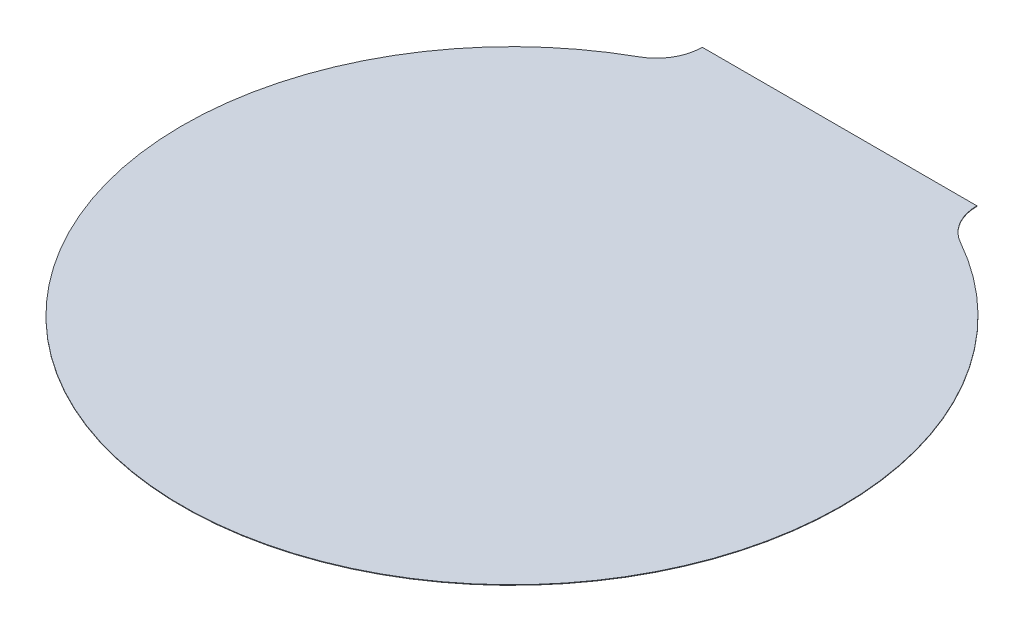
from build123d import *

# Parameters (mm, degrees)
EXTRUDE1_DEPTH = 0.015


with BuildPart() as part:
    # Sketch1 → Extrude1 (new body)
    with BuildSketch(Plane(origin=(0, 0, 0), x_dir=(1, 0, 0), z_dir=(0, 1, 0))):
        with BuildLine():
            Line((3.8096924, 9.091101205), (-3.8096924, 9.091101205))
            ThreePointArc((-3.8096924, 9.091101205), (-3.984331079, 8.448385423), (-4.460217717, 7.982430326))
            ThreePointArc((-4.460217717, 7.982430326), (0, -9.144), (4.460217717, 7.982430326))
            ThreePointArc((4.460217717, 7.982430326), (3.984331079, 8.448385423), (3.8096924, 9.091101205))
        make_face()
    extrude(amount=EXTRUDE1_DEPTH)


solid = part.part
